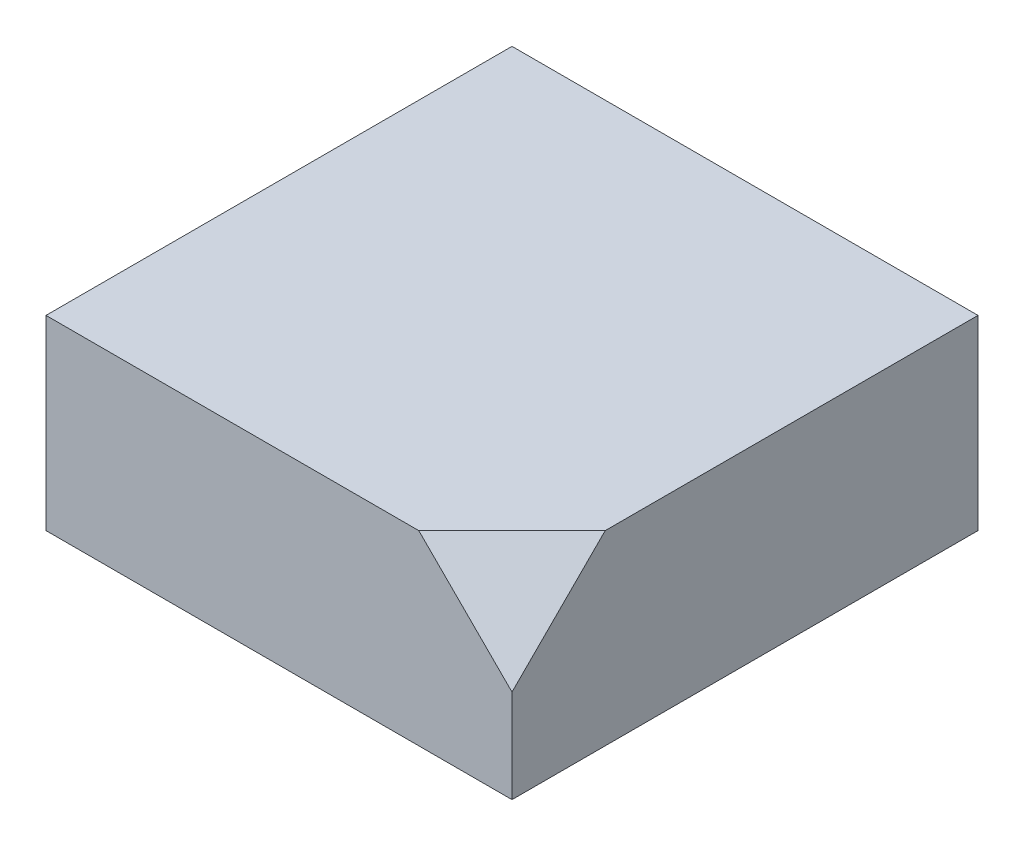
ISO-10303-21;
HEADER;
FILE_DESCRIPTION(('STEP AP214'),'2;1');
FILE_NAME('part.step','',(''),(''),'','','');
FILE_SCHEMA(('AUTOMOTIVE_DESIGN { 1 0 10303 214 1 1 1 1 }'));
ENDSEC;
DATA;
#1=APPLICATION_CONTEXT('core data for automotive mechanical design processes');
#2=APPLICATION_PROTOCOL_DEFINITION('international standard','automotive_design',2000,#1);
#3=PRODUCT_CONTEXT('',#1,'mechanical');
#4=PRODUCT('Part','Part','',(#3));
#5=PRODUCT_RELATED_PRODUCT_CATEGORY('part','',(#4));
#6=PRODUCT_DEFINITION_FORMATION('','',#4);
#7=PRODUCT_DEFINITION_CONTEXT('part definition',#1,'design');
#8=PRODUCT_DEFINITION('design','',#6,#7);
#9=PRODUCT_DEFINITION_SHAPE('','',#8);
#10=(LENGTH_UNIT() NAMED_UNIT(*) SI_UNIT(.MILLI.,.METRE.));
#11=(NAMED_UNIT(*) PLANE_ANGLE_UNIT() SI_UNIT($,.RADIAN.));
#12=(NAMED_UNIT(*) SI_UNIT($,.STERADIAN.) SOLID_ANGLE_UNIT());
#13=UNCERTAINTY_MEASURE_WITH_UNIT(LENGTH_MEASURE(1.E-05),#10,'distance_accuracy_value','');
#14=(GEOMETRIC_REPRESENTATION_CONTEXT(3) GLOBAL_UNCERTAINTY_ASSIGNED_CONTEXT((#13)) GLOBAL_UNIT_ASSIGNED_CONTEXT((#10,
#11,#12)) REPRESENTATION_CONTEXT('',''));
#15=CARTESIAN_POINT('',(0.,0.,0.));
#16=DIRECTION('',(0.,0.,1.));
#17=DIRECTION('',(1.,0.,0.));
#18=AXIS2_PLACEMENT_3D('',#15,#16,#17);
#19=CARTESIAN_POINT('',(-25.,20.,-25.));
#20=DIRECTION('',(0.,1.,0.));
#21=DIRECTION('',(0.,0.,1.));
#22=AXIS2_PLACEMENT_3D('',#19,#20,#21);
#23=PLANE('',#22);
#24=DIRECTION('',(1.,0.,0.));
#25=VECTOR('',#24,1.);
#26=CARTESIAN_POINT('',(-25.,20.,25.));
#27=LINE('',#26,#25);
#28=CARTESIAN_POINT('',(-25.,20.,25.));
#29=VERTEX_POINT('',#28);
#30=CARTESIAN_POINT('',(15.,20.,25.));
#31=VERTEX_POINT('',#30);
#32=EDGE_CURVE('E81',#29,#31,#27,.T.);
#33=ORIENTED_EDGE('',*,*,#32,.T.);
#34=DIRECTION('',(0.707106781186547,0.,-0.707106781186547));
#35=VECTOR('',#34,1.);
#36=CARTESIAN_POINT('',(20.,20.,20.));
#37=LINE('',#36,#35);
#38=CARTESIAN_POINT('',(25.,20.,15.));
#39=VERTEX_POINT('',#38);
#40=EDGE_CURVE('E11',#31,#39,#37,.T.);
#41=ORIENTED_EDGE('',*,*,#40,.T.);
#42=DIRECTION('',(0.,0.,-1.));
#43=VECTOR('',#42,1.);
#44=CARTESIAN_POINT('',(25.,20.,-25.));
#45=LINE('',#44,#43);
#46=CARTESIAN_POINT('',(25.,20.,-25.));
#47=VERTEX_POINT('',#46);
#48=EDGE_CURVE('E97',#39,#47,#45,.T.);
#49=ORIENTED_EDGE('',*,*,#48,.T.);
#50=DIRECTION('',(-1.,0.,0.));
#51=VECTOR('',#50,1.);
#52=CARTESIAN_POINT('',(-25.,20.,-25.));
#53=LINE('',#52,#51);
#54=CARTESIAN_POINT('',(-25.,20.,-25.));
#55=VERTEX_POINT('',#54);
#56=EDGE_CURVE('E54',#47,#55,#53,.T.);
#57=ORIENTED_EDGE('',*,*,#56,.T.);
#58=DIRECTION('',(0.,0.,1.));
#59=VECTOR('',#58,1.);
#60=CARTESIAN_POINT('',(-25.,20.,-25.));
#61=LINE('',#60,#59);
#62=EDGE_CURVE('E95',#55,#29,#61,.T.);
#63=ORIENTED_EDGE('',*,*,#62,.T.);
#64=EDGE_LOOP('',(#33,#41,#49,#57,#63));
#65=FACE_BOUND('',#64,.T.);
#66=ADVANCED_FACE('F32',(#65),#23,.T.);
#67=CARTESIAN_POINT('',(-25.,20.,-25.));
#68=DIRECTION('',(1.,0.,0.));
#69=DIRECTION('',(0.,0.,-1.));
#70=AXIS2_PLACEMENT_3D('',#67,#68,#69);
#71=PLANE('',#70);
#72=DIRECTION('',(0.,0.,1.));
#73=VECTOR('',#72,1.);
#74=CARTESIAN_POINT('',(-25.,0.,-25.));
#75=LINE('',#74,#73);
#76=CARTESIAN_POINT('',(-25.,0.,-25.));
#77=VERTEX_POINT('',#76);
#78=CARTESIAN_POINT('',(-25.,0.,25.));
#79=VERTEX_POINT('',#78);
#80=EDGE_CURVE('E104',#77,#79,#75,.T.);
#81=ORIENTED_EDGE('',*,*,#80,.T.);
#82=DIRECTION('',(0.,-1.,0.));
#83=VECTOR('',#82,1.);
#84=CARTESIAN_POINT('',(-25.,20.,25.));
#85=LINE('',#84,#83);
#86=EDGE_CURVE('E92',#29,#79,#85,.T.);
#87=ORIENTED_EDGE('',*,*,#86,.F.);
#88=ORIENTED_EDGE('',*,*,#62,.F.);
#89=DIRECTION('',(0.,-1.,0.));
#90=VECTOR('',#89,1.);
#91=CARTESIAN_POINT('',(-25.,20.,-25.));
#92=LINE('',#91,#90);
#93=EDGE_CURVE('E103',#55,#77,#92,.T.);
#94=ORIENTED_EDGE('',*,*,#93,.T.);
#95=EDGE_LOOP('',(#81,#87,#88,#94));
#96=FACE_BOUND('',#95,.T.);
#97=ADVANCED_FACE('F34',(#96),#71,.F.);
#98=CARTESIAN_POINT('',(-25.,20.,25.));
#99=DIRECTION('',(0.,0.,-1.));
#100=DIRECTION('',(-1.,0.,0.));
#101=AXIS2_PLACEMENT_3D('',#98,#99,#100);
#102=PLANE('',#101);
#103=DIRECTION('',(0.707106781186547,-0.707106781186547,0.));
#104=VECTOR('',#103,1.);
#105=CARTESIAN_POINT('',(-5.,40.,25.));
#106=LINE('',#105,#104);
#107=CARTESIAN_POINT('',(25.,9.99999999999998,25.));
#108=VERTEX_POINT('',#107);
#109=EDGE_CURVE('E86',#31,#108,#106,.T.);
#110=ORIENTED_EDGE('',*,*,#109,.F.);
#111=ORIENTED_EDGE('',*,*,#32,.F.);
#112=ORIENTED_EDGE('',*,*,#86,.T.);
#113=DIRECTION('',(1.,0.,0.));
#114=VECTOR('',#113,1.);
#115=CARTESIAN_POINT('',(-25.,0.,25.));
#116=LINE('',#115,#114);
#117=CARTESIAN_POINT('',(25.,0.,25.));
#118=VERTEX_POINT('',#117);
#119=EDGE_CURVE('E107',#79,#118,#116,.T.);
#120=ORIENTED_EDGE('',*,*,#119,.T.);
#121=DIRECTION('',(0.,-1.,0.));
#122=VECTOR('',#121,1.);
#123=CARTESIAN_POINT('',(25.,20.,25.));
#124=LINE('',#123,#122);
#125=EDGE_CURVE('E91',#108,#118,#124,.T.);
#126=ORIENTED_EDGE('',*,*,#125,.F.);
#127=EDGE_LOOP('',(#110,#111,#112,#120,#126));
#128=FACE_BOUND('',#127,.T.);
#129=ADVANCED_FACE('F89',(#128),#102,.F.);
#130=CARTESIAN_POINT('',(25.,20.,-25.));
#131=DIRECTION('',(-1.,0.,0.));
#132=DIRECTION('',(0.,0.,1.));
#133=AXIS2_PLACEMENT_3D('',#130,#131,#132);
#134=PLANE('',#133);
#135=DIRECTION('',(0.,0.707106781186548,-0.707106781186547));
#136=VECTOR('',#135,1.);
#137=CARTESIAN_POINT('',(25.,40.,-5.));
#138=LINE('',#137,#136);
#139=EDGE_CURVE('E40',#108,#39,#138,.T.);
#140=ORIENTED_EDGE('',*,*,#139,.F.);
#141=ORIENTED_EDGE('',*,*,#125,.T.);
#142=DIRECTION('',(0.,0.,-1.));
#143=VECTOR('',#142,1.);
#144=CARTESIAN_POINT('',(25.,0.,-25.));
#145=LINE('',#144,#143);
#146=CARTESIAN_POINT('',(25.,0.,-25.));
#147=VERTEX_POINT('',#146);
#148=EDGE_CURVE('E109',#118,#147,#145,.T.);
#149=ORIENTED_EDGE('',*,*,#148,.T.);
#150=DIRECTION('',(0.,-1.,0.));
#151=VECTOR('',#150,1.);
#152=CARTESIAN_POINT('',(25.,20.,-25.));
#153=LINE('',#152,#151);
#154=EDGE_CURVE('E113',#47,#147,#153,.T.);
#155=ORIENTED_EDGE('',*,*,#154,.F.);
#156=ORIENTED_EDGE('',*,*,#48,.F.);
#157=EDGE_LOOP('',(#140,#141,#149,#155,#156));
#158=FACE_BOUND('',#157,.T.);
#159=ADVANCED_FACE('F123',(#158),#134,.F.);
#160=CARTESIAN_POINT('',(-25.,20.,-25.));
#161=DIRECTION('',(0.,0.,1.));
#162=DIRECTION('',(1.,0.,0.));
#163=AXIS2_PLACEMENT_3D('',#160,#161,#162);
#164=PLANE('',#163);
#165=DIRECTION('',(-1.,0.,0.));
#166=VECTOR('',#165,1.);
#167=CARTESIAN_POINT('',(-25.,0.,-25.));
#168=LINE('',#167,#166);
#169=EDGE_CURVE('E74',#147,#77,#168,.T.);
#170=ORIENTED_EDGE('',*,*,#169,.T.);
#171=ORIENTED_EDGE('',*,*,#93,.F.);
#172=ORIENTED_EDGE('',*,*,#56,.F.);
#173=ORIENTED_EDGE('',*,*,#154,.T.);
#174=EDGE_LOOP('',(#170,#171,#172,#173));
#175=FACE_BOUND('',#174,.T.);
#176=ADVANCED_FACE('F124',(#175),#164,.F.);
#177=CARTESIAN_POINT('',(-25.,0.,-25.));
#178=DIRECTION('',(0.,1.,0.));
#179=DIRECTION('',(0.,0.,1.));
#180=AXIS2_PLACEMENT_3D('',#177,#178,#179);
#181=PLANE('',#180);
#182=ORIENTED_EDGE('',*,*,#80,.F.);
#183=ORIENTED_EDGE('',*,*,#169,.F.);
#184=ORIENTED_EDGE('',*,*,#148,.F.);
#185=ORIENTED_EDGE('',*,*,#119,.F.);
#186=EDGE_LOOP('',(#182,#183,#184,#185));
#187=FACE_BOUND('',#186,.T.);
#188=ADVANCED_FACE('F120',(#187),#181,.F.);
#189=CARTESIAN_POINT('',(20.,20.,20.));
#190=DIRECTION('',(0.577350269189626,0.577350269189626,0.577350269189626));
#191=DIRECTION('',(0.707106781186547,0.,-0.707106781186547));
#192=AXIS2_PLACEMENT_3D('',#189,#190,#191);
#193=PLANE('',#192);
#194=ORIENTED_EDGE('',*,*,#40,.F.);
#195=ORIENTED_EDGE('',*,*,#109,.T.);
#196=ORIENTED_EDGE('',*,*,#139,.T.);
#197=EDGE_LOOP('',(#194,#195,#196));
#198=FACE_BOUND('',#197,.T.);
#199=ADVANCED_FACE('F85',(#198),#193,.T.);
#200=CLOSED_SHELL('',(#66,#97,#129,#159,#176,#188,#199));
#201=MANIFOLD_SOLID_BREP('B2',#200);
#202=ADVANCED_BREP_SHAPE_REPRESENTATION('',(#18,#201),#14);
#203=SHAPE_DEFINITION_REPRESENTATION(#9,#202);
ENDSEC;
END-ISO-10303-21;
